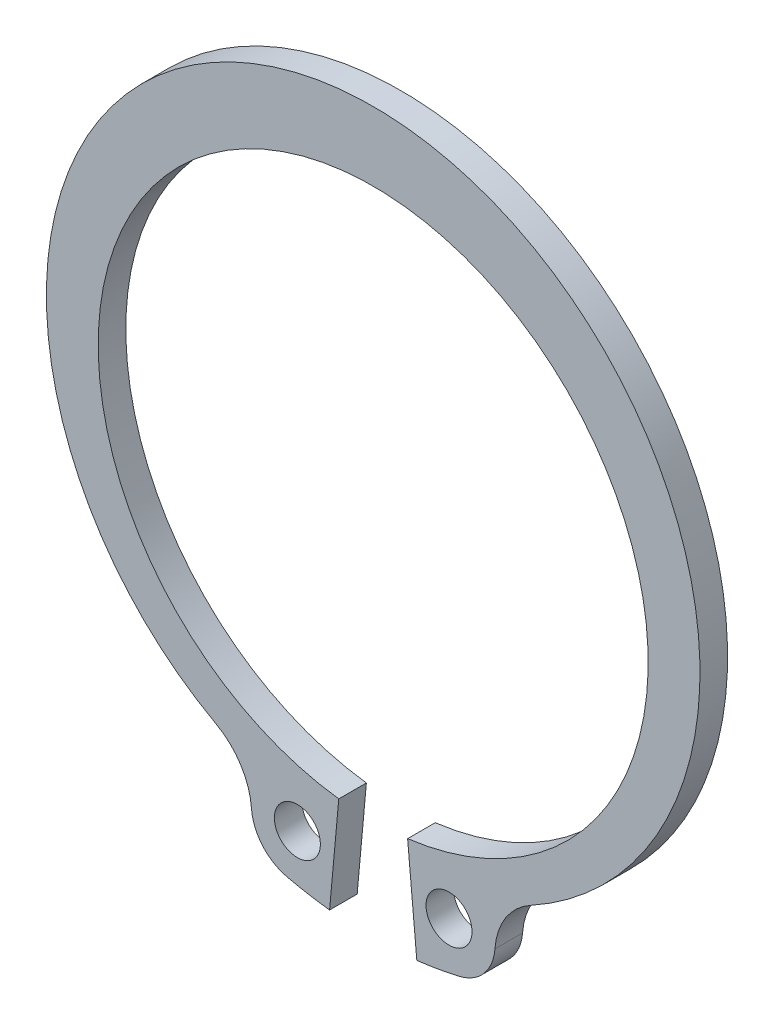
from build123d import *

# Parameters (mm, degrees)
ESQUISSE1_R          = 1
BASE_EXTRUSION_DEPTH = 1.2


with BuildPart() as part:
    # Esquisse1 → Base-Extrusion (new body)
    with BuildSketch(Plane.XY):
        with BuildLine():
            Line((1.495703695, -11.856026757), (1.895564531, -16.237819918))
            ThreePointArc((1.895564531, -16.237819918), (2.829518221, -16.101359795), (3.754039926, -15.911227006))
            ThreePointArc((3.754039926, -15.911227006), (4.81722072, -15.261654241), (5.289579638, -14.10875562))
            ThreePointArc((5.289579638, -14.10875562), (5.756515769, -12.705307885), (6.83728717, -11.695541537))
            ThreePointArc((6.83728717, -11.695541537), (0, 14.95), (-6.83728717, -11.695541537))
            ThreePointArc((-6.83728717, -11.695541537), (-5.756515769, -12.705307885), (-5.289579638, -14.10875562))
            ThreePointArc((-5.289579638, -14.10875562), (-4.81722072, -15.261654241), (-3.754039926, -15.911227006))
            ThreePointArc((-3.754039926, -15.911227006), (-2.829518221, -16.101359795), (-1.895564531, -16.237819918))
            Line((-1.895564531, -16.237819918), (-1.495703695, -11.856026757))
            ThreePointArc((-1.495703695, -11.856026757), (0, 11.95), (1.495703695, -11.856026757))
        make_face()
        with Locations((3.294776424, -13.964671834)):
            Circle(ESQUISSE1_R, mode=Mode.SUBTRACT)
        with Locations(Location((-3.294776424, -13.964671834, 0), (0, 0, 180))):
            Circle(ESQUISSE1_R, mode=Mode.SUBTRACT)
    extrude(amount=BASE_EXTRUSION_DEPTH)


solid = part.part
